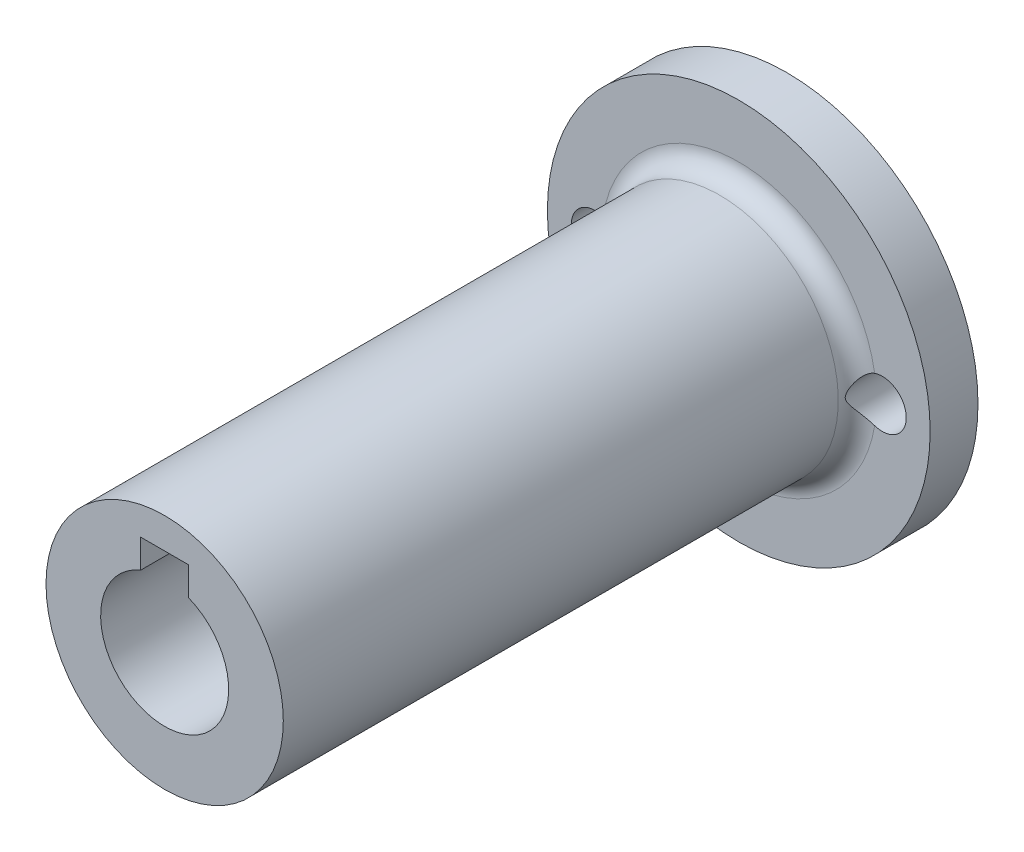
from build123d import *

# Parameters (mm, degrees)
SKETCH1_R           = 25.4
BOSS_EXTRUDE1_DEPTH = 6.35
SKETCH2_R           = 15.748
BOSS_EXTRUDE2_DEPTH = 76.2
FILLET1_R           = 2.54
CUT_EXTRUDE2_DEPTH  = 91.02678768
SKETCH4_R           = 3.175
CUT_EXTRUDE3_DEPTH  = 91.02678768


with BuildPart() as part:
    # Sketch1 → Boss-Extrude1 (new body)
    with BuildSketch(Plane.XY):
        Circle(SKETCH1_R)
    extrude(amount=BOSS_EXTRUDE1_DEPTH)

    # Sketch2 → Boss-Extrude2 (add)
    with BuildSketch(Plane.XY.offset(6.35)):
        with Locations(Location((0, 0, 0), (0, 0, 180))):
            Circle(SKETCH2_R)
    extrude(amount=BOSS_EXTRUDE2_DEPTH)

    # Fillet1
    fillet1_edges = [part.edges().sort_by_distance(p)[0] for p in [
        (15.748, 0, 6.35),
    ]]
    fillet(fillet1_edges, radius=FILLET1_R)

    # Sketch3 → Cut-Extrude2 (cut, through all)
    with BuildSketch(Plane.XY.offset(82.55)):
        with BuildLine():
            Line((-3.175, 7.880767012), (-3.175, 5.3213))
            Line((-3.175, 5.3213), (3.175, 5.3213))
            Line((3.175, 5.3213), (3.175, 7.880767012))
            ThreePointArc((3.175, 7.880767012), (0, 8.4963), (-3.175, 7.880767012))
        make_face()
        with BuildLine():
            Line((3.175, 5.3213), (-3.175, 5.3213))
            Line((-3.175, 5.3213), (-3.175, 7.880767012))
            ThreePointArc((-3.175, 7.880767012), (-4.754543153, -7.04140846), (8.4963, 0))
            ThreePointArc((8.4963, 0), (7.04140846, 4.754543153), (3.175, 7.880767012))
            Line((3.175, 7.880767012), (3.175, 5.3213))
        make_face()
        with BuildLine():
            Line((-3.175, 11.6713), (-3.175, 7.880767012))
            ThreePointArc((-3.175, 7.880767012), (0, 8.4963), (3.175, 7.880767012))
            Line((3.175, 7.880767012), (3.175, 11.6713))
            Line((3.175, 11.6713), (-3.175, 11.6713))
        make_face()
    extrude(amount=-CUT_EXTRUDE2_DEPTH, mode=Mode.SUBTRACT)

    # Sketch4 → Cut-Extrude3 (cut, through all)
    with BuildSketch(Plane(origin=(0, 0, 0), x_dir=(-1, 0, 0), z_dir=(0, 0, -1))):
        with Locations((19.05, 0)):
            Circle(SKETCH4_R)
        with Locations(Location((-19.05, 0, 0), (0, 0, 71.425749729))):
            Circle(SKETCH4_R)
    extrude(amount=-CUT_EXTRUDE3_DEPTH, mode=Mode.SUBTRACT)


solid = part.part
